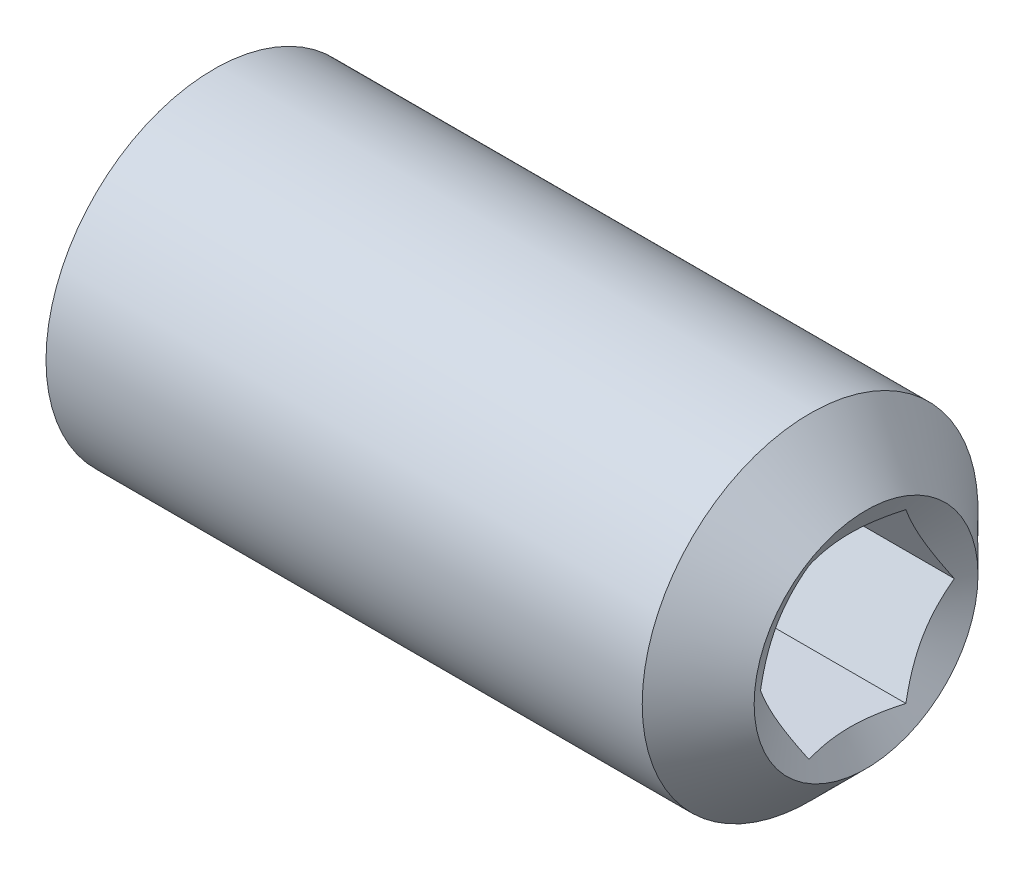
from build123d import *

# Parameters (mm, degrees)
HEX_2_DEPTH = 13.727922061


with BuildPart() as part:
    # BodySke → BaseBody (revolve)
    with BuildSketch(Plane.XY, mode=Mode.PRIVATE) as basebody_sk:
        Polygon((0, 0), (0, 2.4), (0.346410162, 3), (11, 3), (12, 2), (10.845299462, 0), align=None)
    revolve(basebody_sk.sketch.rotate(Axis((-12.7, 0, 0), (1, 0, 0)), 90), axis=Axis((-12.7, 0, 0), (1, 0, 0)))

    # Sketch2 → Hex 2 (cut, through all)
    with BuildSketch(Plane.ZY):
        Polygon((0.866025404, 1.5), (-0.866025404, 1.5), (-1.732050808, 0), (-0.866025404, -1.5), (0.866025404, -1.5), (1.732050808, 0), align=None)
    extrude(amount=-HEX_2_DEPTH, mode=Mode.SUBTRACT)


solid = part.part
